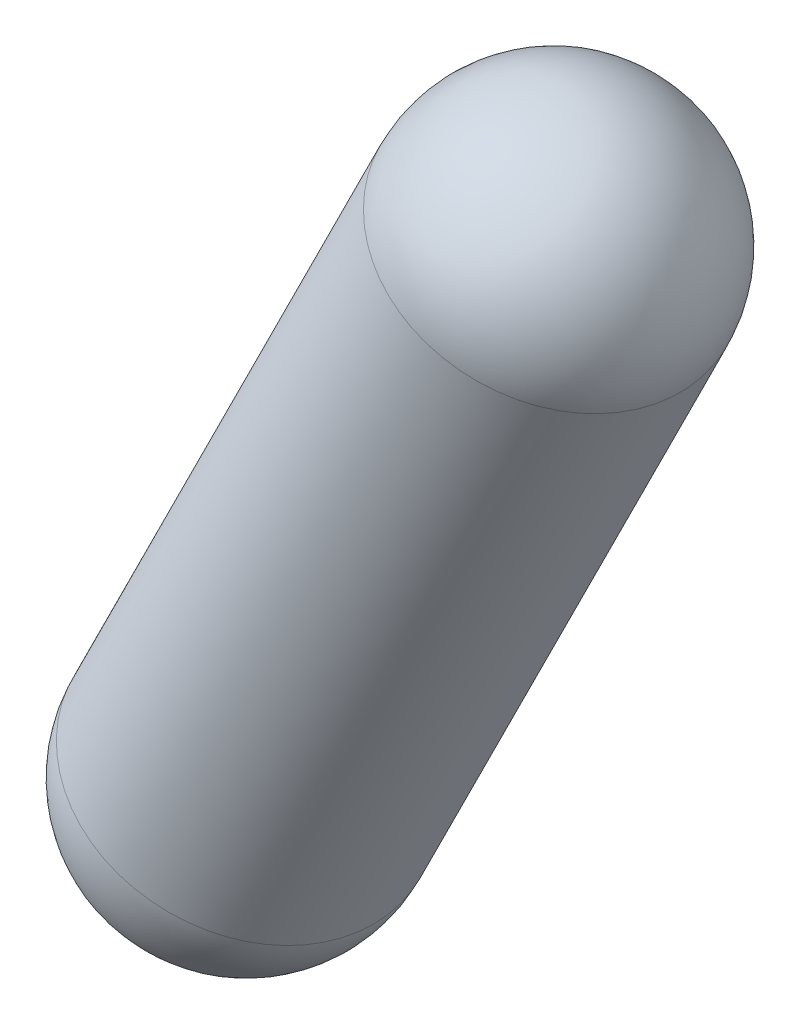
ISO-10303-21;
HEADER;
FILE_DESCRIPTION(('STEP AP214'),'2;1');
FILE_NAME('part.step','',(''),(''),'','','');
FILE_SCHEMA(('AUTOMOTIVE_DESIGN { 1 0 10303 214 1 1 1 1 }'));
ENDSEC;
DATA;
#1=APPLICATION_CONTEXT('core data for automotive mechanical design processes');
#2=APPLICATION_PROTOCOL_DEFINITION('international standard','automotive_design',2000,#1);
#3=PRODUCT_CONTEXT('',#1,'mechanical');
#4=PRODUCT('Part','Part','',(#3));
#5=PRODUCT_RELATED_PRODUCT_CATEGORY('part','',(#4));
#6=PRODUCT_DEFINITION_FORMATION('','',#4);
#7=PRODUCT_DEFINITION_CONTEXT('part definition',#1,'design');
#8=PRODUCT_DEFINITION('design','',#6,#7);
#9=PRODUCT_DEFINITION_SHAPE('','',#8);
#10=(LENGTH_UNIT() NAMED_UNIT(*) SI_UNIT(.MILLI.,.METRE.));
#11=(NAMED_UNIT(*) PLANE_ANGLE_UNIT() SI_UNIT($,.RADIAN.));
#12=(NAMED_UNIT(*) SI_UNIT($,.STERADIAN.) SOLID_ANGLE_UNIT());
#13=UNCERTAINTY_MEASURE_WITH_UNIT(LENGTH_MEASURE(1.E-05),#10,'distance_accuracy_value','');
#14=(GEOMETRIC_REPRESENTATION_CONTEXT(3) GLOBAL_UNCERTAINTY_ASSIGNED_CONTEXT((#13)) GLOBAL_UNIT_ASSIGNED_CONTEXT((#10,
#11,#12)) REPRESENTATION_CONTEXT('',''));
#15=CARTESIAN_POINT('',(0.,0.,0.));
#16=DIRECTION('',(0.,0.,1.));
#17=DIRECTION('',(1.,0.,0.));
#18=AXIS2_PLACEMENT_3D('',#15,#16,#17);
#19=CARTESIAN_POINT('',(-54.25,-82.5,0.));
#20=DIRECTION('',(0.447213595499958,0.894427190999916,0.));
#21=DIRECTION('',(0.,0.,-1.));
#22=AXIS2_PLACEMENT_3D('',#19,#20,#21);
#23=CYLINDRICAL_SURFACE('',#22,1.5);
#24=CARTESIAN_POINT('',(-51.,-76.,0.));
#25=DIRECTION('',(0.447213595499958,0.894427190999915,0.));
#26=DIRECTION('',(-0.894427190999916,0.447213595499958,0.));
#27=AXIS2_PLACEMENT_3D('',#24,#25,#26);
#28=CIRCLE('',#27,1.5);
#29=CARTESIAN_POINT('',(-51.,-76.,-1.5));
#30=VERTEX_POINT('',#29);
#31=CARTESIAN_POINT('',(-51.,-76.,1.5));
#32=VERTEX_POINT('',#31);
#33=EDGE_CURVE('E11',#30,#32,#28,.T.);
#34=ORIENTED_EDGE('',*,*,#33,.F.);
#35=CARTESIAN_POINT('',(-51.,-76.,0.));
#36=DIRECTION('',(-0.447213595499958,-0.894427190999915,0.));
#37=DIRECTION('',(0.894427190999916,-0.447213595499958,0.));
#38=AXIS2_PLACEMENT_3D('',#35,#36,#37);
#39=CIRCLE('',#38,1.5);
#40=EDGE_CURVE('E24',#30,#32,#39,.T.);
#41=ORIENTED_EDGE('',*,*,#40,.T.);
#42=EDGE_LOOP('',(#34,#41));
#43=FACE_BOUND('',#42,.T.);
#44=CARTESIAN_POINT('',(-54.25,-82.5,0.));
#45=DIRECTION('',(0.447213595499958,0.894427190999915,0.));
#46=DIRECTION('',(-0.894427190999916,0.447213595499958,0.));
#47=AXIS2_PLACEMENT_3D('',#44,#45,#46);
#48=CIRCLE('',#47,1.5);
#49=CARTESIAN_POINT('',(-54.25,-82.5,-1.5));
#50=VERTEX_POINT('',#49);
#51=CARTESIAN_POINT('',(-54.25,-82.5,1.5));
#52=VERTEX_POINT('',#51);
#53=EDGE_CURVE('E41',#50,#52,#48,.T.);
#54=ORIENTED_EDGE('',*,*,#53,.T.);
#55=CARTESIAN_POINT('',(-54.25,-82.5,0.));
#56=DIRECTION('',(-0.447213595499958,-0.894427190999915,0.));
#57=DIRECTION('',(0.894427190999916,-0.447213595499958,0.));
#58=AXIS2_PLACEMENT_3D('',#55,#56,#57);
#59=CIRCLE('',#58,1.5);
#60=EDGE_CURVE('E30',#50,#52,#59,.T.);
#61=ORIENTED_EDGE('',*,*,#60,.F.);
#62=EDGE_LOOP('',(#54,#61));
#63=FACE_BOUND('',#62,.T.);
#64=ADVANCED_FACE('F16',(#43,#63),#23,.T.);
#65=CARTESIAN_POINT('',(-51.,-76.,0.));
#66=DIRECTION('',(0.,0.,1.));
#67=DIRECTION('',(-0.894427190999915,0.447213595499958,0.));
#68=AXIS2_PLACEMENT_3D('',#65,#66,#67);
#69=SPHERICAL_SURFACE('',#68,1.5);
#70=CARTESIAN_POINT('',(-51.,-76.,0.));
#71=DIRECTION('',(0.447213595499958,0.894427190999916,0.));
#72=DIRECTION('',(-0.894427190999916,0.447213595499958,0.));
#73=AXIS2_PLACEMENT_3D('',#70,#71,#72);
#74=SPHERICAL_SURFACE('',#73,1.5);
#75=ORIENTED_EDGE('',*,*,#33,.T.);
#76=ORIENTED_EDGE('',*,*,#40,.F.);
#77=EDGE_LOOP('',(#75,#76));
#78=FACE_BOUND('',#77,.T.);
#79=ADVANCED_FACE('F62',(#78),#74,.T.);
#80=CARTESIAN_POINT('',(-54.25,-82.5,0.));
#81=DIRECTION('',(0.,0.,1.));
#82=DIRECTION('',(0.894427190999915,-0.447213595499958,0.));
#83=AXIS2_PLACEMENT_3D('',#80,#81,#82);
#84=SPHERICAL_SURFACE('',#83,1.5);
#85=CARTESIAN_POINT('',(-54.25,-82.5,0.));
#86=DIRECTION('',(-0.447213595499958,-0.894427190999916,0.));
#87=DIRECTION('',(0.894427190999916,-0.447213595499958,0.));
#88=AXIS2_PLACEMENT_3D('',#85,#86,#87);
#89=SPHERICAL_SURFACE('',#88,1.5);
#90=ORIENTED_EDGE('',*,*,#60,.T.);
#91=ORIENTED_EDGE('',*,*,#53,.F.);
#92=EDGE_LOOP('',(#90,#91));
#93=FACE_BOUND('',#92,.T.);
#94=ADVANCED_FACE('F44',(#93),#89,.T.);
#95=CLOSED_SHELL('',(#64,#79,#94));
#96=MANIFOLD_SOLID_BREP('B1',#95);
#97=ADVANCED_BREP_SHAPE_REPRESENTATION('',(#18,#96),#14);
#98=SHAPE_DEFINITION_REPRESENTATION(#9,#97);
ENDSEC;
END-ISO-10303-21;
